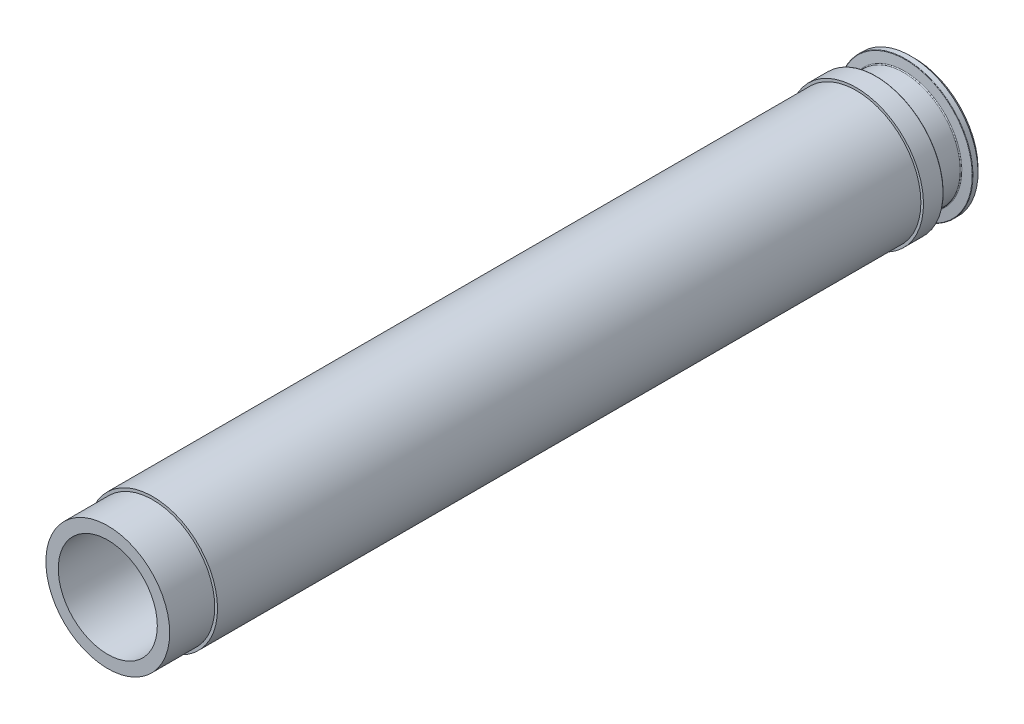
from build123d import *

# Parameters (mm, degrees)
SKETCH1_R           = 17.4625
BASE_EXTRUDE_DEPTH  = 211.0994
SKETCH2_R           = 18.25625
BOSS_EXTRUDE1_DEPTH = 198.3994
SKETCH4_R           = 13.97
CUT_EXTRUDE1_DEPTH  = 211.074


with BuildPart() as part:
    # Sketch1 → Base-Extrude (new body)
    with BuildSketch(Plane.XY):
        Circle(SKETCH1_R)
    extrude(amount=-BASE_EXTRUDE_DEPTH)

    # Sketch2 → Boss-Extrude1 (add)
    with BuildSketch(Plane(origin=(0, 0, -12.7), x_dir=(-1, 0, 0), z_dir=(0, 0, -1))):
        with Locations(Location((0, 0, 0), (0, 0, 180))):
            Circle(SKETCH2_R)
    extrude(amount=BOSS_EXTRUDE1_DEPTH)

    # Sketch3 → Boss-Revolve1 (revolve)
    with BuildSketch(Plane(origin=(0, 0, 0), x_dir=(0, 0, -1), z_dir=(1, 0, 0)), mode=Mode.PRIVATE) as boss_revolve1_sk:
        with BuildLine():
            Line((211.0994, 0), (211.0994, 18.9865))
            Line((211.0994, 18.9865), (216.596425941, 18.9865))
            ThreePointArc((216.596425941, 18.9865), (216.682225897, 18.953134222), (216.722942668, 18.870568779))
            Line((216.722942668, 18.870568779), (216.956957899, 16.195762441))
            ThreePointArc((216.956957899, 16.195762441), (217.03839144, 16.030631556), (217.209991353, 15.9639))
            Line((217.209991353, 15.9639), (224.466095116, 15.9639))
            ThreePointArc((224.466095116, 15.9639), (224.637695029, 16.030631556), (224.719128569, 16.195762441))
            Line((224.719128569, 16.195762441), (224.953143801, 18.870568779))
            ThreePointArc((224.953143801, 18.870568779), (224.993860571, 18.953134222), (225.079660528, 18.9865))
            Line((225.079660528, 18.9865), (226.487286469, 18.9865))
            Line((226.487286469, 18.9865), (227.503286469, 17.9705))
            Line((227.503286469, 17.9705), (227.503286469, 0))
            Line((227.503286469, 0), (211.0994, 0))
        make_face()
    revolve(boss_revolve1_sk.sketch.rotate(Axis((0, 0, -211.0994), (0, 0, -1)), 180), axis=Axis((0, 0, -211.0994), (0, 0, -1)))

    # Sketch4 → Cut-Extrude1 (cut)
    with BuildSketch(Plane.XY):
        Circle(SKETCH4_R)
    extrude(amount=-CUT_EXTRUDE1_DEPTH, mode=Mode.SUBTRACT)


solid = part.part
